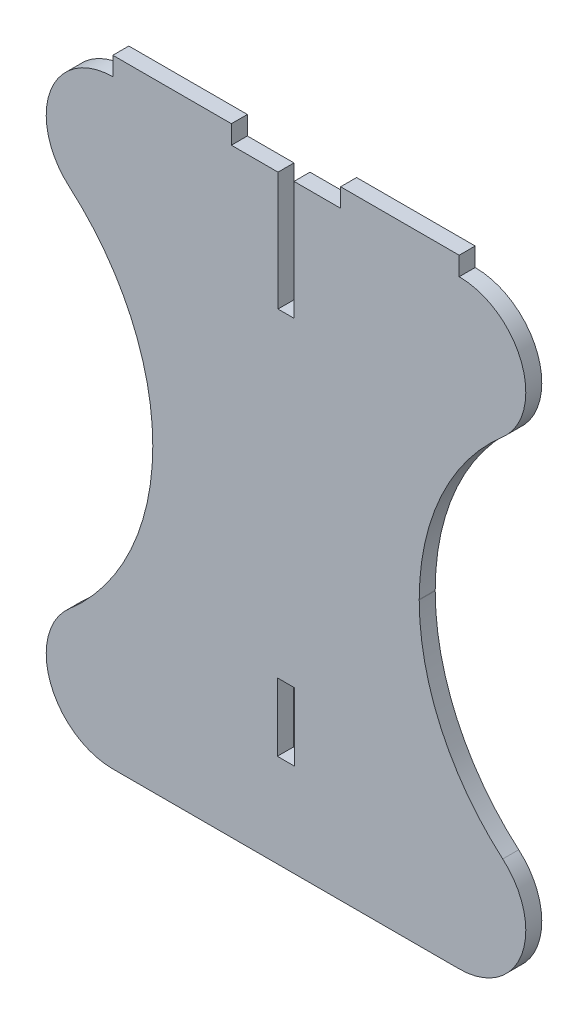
from build123d import *

# Parameters (mm, degrees)
BOSS_EXTRUDE2_DEPTH = 12
FILLET2_R           = 181
SKETCH2_W           = 89
SKETCH2_H           = 14
BOSS_EXTRUDE4_DEPTH = 12
SKETCH3_W           = 13
SKETCH3_H           = 51
CUT_EXTRUDE1_DEPTH  = 12


with BuildPart() as part:
    # Sketch1 → Boss-Extrude2 (new body)
    with BuildSketch(Plane.XY):
        with BuildLine():
            Line((80, 350), (80, 100))
            Line((80, 100), (50, 100))
            ThreePointArc((50, 100), (0, 50), (50, 0))
            Line((50, 0), (310, 0))
            ThreePointArc((310, 0), (360, 50), (310, 100))
            Line((310, 100), (280, 100))
            Line((280, 100), (280, 350))
            Line((280, 350), (310, 350))
            ThreePointArc((310, 350), (360, 400), (310, 450))
            Line((310, 450), (50, 450))
            ThreePointArc((50, 450), (0, 400), (50, 350))
            Line((50, 350), (80, 350))
        make_face()
    extrude(amount=BOSS_EXTRUDE2_DEPTH)

    # Fillet2
    fillet2_edges = [part.edges().sort_by_distance(p)[0] for p in [
        (80, 100, 6),
        (280, 100, 6),
        (280, 350, 6),
        (80, 350, 6),
    ]]
    fillet(fillet2_edges, radius=FILLET2_R)

    # Sketch2 → Boss-Extrude4 (add)
    with BuildSketch(Plane.XY.offset(12)):
        with Locations((94.5, 457)):
            Rectangle(SKETCH2_W, SKETCH2_H)
        with Locations((265.5, 457)):
            Rectangle(SKETCH2_W, SKETCH2_H)
    extrude(amount=-BOSS_EXTRUDE4_DEPTH)

    # Sketch3 → Cut-Extrude1 (cut)
    with BuildSketch(Plane.XY.offset(12)):
        Polygon((174, 450), (174, 361), (186, 361), (186, 450), (180, 450), align=None)
        with Locations((180, 95.5)):
            Rectangle(SKETCH3_W, SKETCH3_H)
    extrude(amount=-CUT_EXTRUDE1_DEPTH, mode=Mode.SUBTRACT)


solid = part.part
